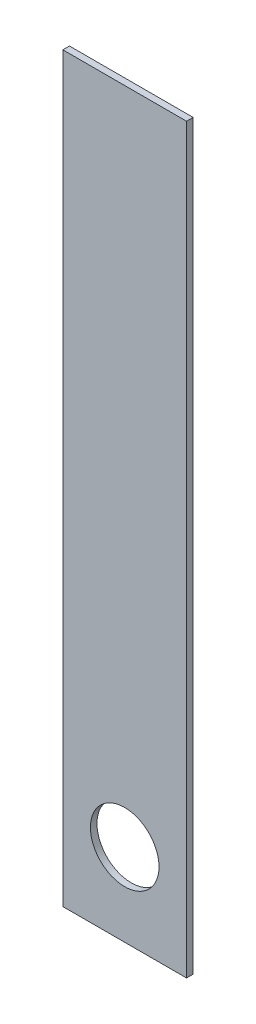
ISO-10303-21;
HEADER;
FILE_DESCRIPTION(('STEP AP214'),'2;1');
FILE_NAME('part.step','',(''),(''),'','','');
FILE_SCHEMA(('AUTOMOTIVE_DESIGN { 1 0 10303 214 1 1 1 1 }'));
ENDSEC;
DATA;
#1=APPLICATION_CONTEXT('core data for automotive mechanical design processes');
#2=APPLICATION_PROTOCOL_DEFINITION('international standard','automotive_design',2000,#1);
#3=PRODUCT_CONTEXT('',#1,'mechanical');
#4=PRODUCT('Part','Part','',(#3));
#5=PRODUCT_RELATED_PRODUCT_CATEGORY('part','',(#4));
#6=PRODUCT_DEFINITION_FORMATION('','',#4);
#7=PRODUCT_DEFINITION_CONTEXT('part definition',#1,'design');
#8=PRODUCT_DEFINITION('design','',#6,#7);
#9=PRODUCT_DEFINITION_SHAPE('','',#8);
#10=(LENGTH_UNIT() NAMED_UNIT(*) SI_UNIT(.MILLI.,.METRE.));
#11=(NAMED_UNIT(*) PLANE_ANGLE_UNIT() SI_UNIT($,.RADIAN.));
#12=(NAMED_UNIT(*) SI_UNIT($,.STERADIAN.) SOLID_ANGLE_UNIT());
#13=UNCERTAINTY_MEASURE_WITH_UNIT(LENGTH_MEASURE(1.E-05),#10,'distance_accuracy_value','');
#14=(GEOMETRIC_REPRESENTATION_CONTEXT(3) GLOBAL_UNCERTAINTY_ASSIGNED_CONTEXT((#13)) GLOBAL_UNIT_ASSIGNED_CONTEXT((#10,
#11,#12)) REPRESENTATION_CONTEXT('',''));
#15=CARTESIAN_POINT('',(0.,0.,0.));
#16=DIRECTION('',(0.,0.,1.));
#17=DIRECTION('',(1.,0.,0.));
#18=AXIS2_PLACEMENT_3D('',#15,#16,#17);
#19=CARTESIAN_POINT('',(-2.38125000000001,0.,0.254));
#20=DIRECTION('',(1.,0.,0.));
#21=DIRECTION('',(0.,0.,-1.));
#22=AXIS2_PLACEMENT_3D('',#19,#20,#21);
#23=PLANE('',#22);
#24=DIRECTION('',(0.,-1.,0.));
#25=VECTOR('',#24,1.);
#26=CARTESIAN_POINT('',(-2.38125000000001,0.,0.));
#27=LINE('',#26,#25);
#28=CARTESIAN_POINT('',(-2.38125000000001,28.575,0.));
#29=VERTEX_POINT('',#28);
#30=CARTESIAN_POINT('',(-2.38125000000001,0.,0.));
#31=VERTEX_POINT('',#30);
#32=EDGE_CURVE('E76',#29,#31,#27,.T.);
#33=ORIENTED_EDGE('',*,*,#32,.T.);
#34=DIRECTION('',(0.,0.,-1.));
#35=VECTOR('',#34,1.);
#36=CARTESIAN_POINT('',(-2.38125000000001,0.,0.254));
#37=LINE('',#36,#35);
#38=CARTESIAN_POINT('',(-2.38125000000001,0.,0.254));
#39=VERTEX_POINT('',#38);
#40=EDGE_CURVE('E11',#39,#31,#37,.T.);
#41=ORIENTED_EDGE('',*,*,#40,.F.);
#42=DIRECTION('',(0.,-1.,0.));
#43=VECTOR('',#42,1.);
#44=CARTESIAN_POINT('',(-2.38125000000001,0.,0.254));
#45=LINE('',#44,#43);
#46=CARTESIAN_POINT('',(-2.38125000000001,28.575,0.254));
#47=VERTEX_POINT('',#46);
#48=EDGE_CURVE('E99',#47,#39,#45,.T.);
#49=ORIENTED_EDGE('',*,*,#48,.F.);
#50=DIRECTION('',(0.,0.,-1.));
#51=VECTOR('',#50,1.);
#52=CARTESIAN_POINT('',(-2.38125000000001,28.575,0.254));
#53=LINE('',#52,#51);
#54=EDGE_CURVE('E88',#47,#29,#53,.T.);
#55=ORIENTED_EDGE('',*,*,#54,.T.);
#56=EDGE_LOOP('',(#33,#41,#49,#55));
#57=FACE_BOUND('',#56,.T.);
#58=ADVANCED_FACE('F32',(#57),#23,.F.);
#59=CARTESIAN_POINT('',(-2.38125000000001,0.,0.254));
#60=DIRECTION('',(0.,1.,0.));
#61=DIRECTION('',(-1.,0.,0.));
#62=AXIS2_PLACEMENT_3D('',#59,#60,#61);
#63=PLANE('',#62);
#64=DIRECTION('',(1.,0.,0.));
#65=VECTOR('',#64,1.);
#66=CARTESIAN_POINT('',(-2.38125000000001,0.,0.));
#67=LINE('',#66,#65);
#68=CARTESIAN_POINT('',(2.38125000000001,0.,0.));
#69=VERTEX_POINT('',#68);
#70=EDGE_CURVE('E72',#31,#69,#67,.T.);
#71=ORIENTED_EDGE('',*,*,#70,.T.);
#72=DIRECTION('',(0.,0.,-1.));
#73=VECTOR('',#72,1.);
#74=CARTESIAN_POINT('',(2.38125000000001,0.,0.254));
#75=LINE('',#74,#73);
#76=CARTESIAN_POINT('',(2.38125000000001,0.,0.254));
#77=VERTEX_POINT('',#76);
#78=EDGE_CURVE('E39',#77,#69,#75,.T.);
#79=ORIENTED_EDGE('',*,*,#78,.F.);
#80=DIRECTION('',(1.,0.,0.));
#81=VECTOR('',#80,1.);
#82=CARTESIAN_POINT('',(-2.38125000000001,0.,0.254));
#83=LINE('',#82,#81);
#84=EDGE_CURVE('E84',#39,#77,#83,.T.);
#85=ORIENTED_EDGE('',*,*,#84,.F.);
#86=ORIENTED_EDGE('',*,*,#40,.T.);
#87=EDGE_LOOP('',(#71,#79,#85,#86));
#88=FACE_BOUND('',#87,.T.);
#89=ADVANCED_FACE('F83',(#88),#63,.F.);
#90=CARTESIAN_POINT('',(2.38125000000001,0.,0.254));
#91=DIRECTION('',(-1.,0.,0.));
#92=DIRECTION('',(0.,-1.,0.));
#93=AXIS2_PLACEMENT_3D('',#90,#91,#92);
#94=PLANE('',#93);
#95=DIRECTION('',(0.,1.,0.));
#96=VECTOR('',#95,1.);
#97=CARTESIAN_POINT('',(2.38125000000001,0.,0.));
#98=LINE('',#97,#96);
#99=CARTESIAN_POINT('',(2.38124999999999,28.575,0.));
#100=VERTEX_POINT('',#99);
#101=EDGE_CURVE('E77',#69,#100,#98,.T.);
#102=ORIENTED_EDGE('',*,*,#101,.T.);
#103=DIRECTION('',(0.,0.,-1.));
#104=VECTOR('',#103,1.);
#105=CARTESIAN_POINT('',(2.38124999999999,28.575,0.254));
#106=LINE('',#105,#104);
#107=CARTESIAN_POINT('',(2.38124999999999,28.575,0.254));
#108=VERTEX_POINT('',#107);
#109=EDGE_CURVE('E105',#108,#100,#106,.T.);
#110=ORIENTED_EDGE('',*,*,#109,.F.);
#111=DIRECTION('',(0.,1.,0.));
#112=VECTOR('',#111,1.);
#113=CARTESIAN_POINT('',(2.38125000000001,0.,0.254));
#114=LINE('',#113,#112);
#115=EDGE_CURVE('E51',#77,#108,#114,.T.);
#116=ORIENTED_EDGE('',*,*,#115,.F.);
#117=ORIENTED_EDGE('',*,*,#78,.T.);
#118=EDGE_LOOP('',(#102,#110,#116,#117));
#119=FACE_BOUND('',#118,.T.);
#120=ADVANCED_FACE('F108',(#119),#94,.F.);
#121=CARTESIAN_POINT('',(-2.38125000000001,28.575,0.254));
#122=DIRECTION('',(0.,-1.,0.));
#123=DIRECTION('',(0.,0.,-1.));
#124=AXIS2_PLACEMENT_3D('',#121,#122,#123);
#125=PLANE('',#124);
#126=DIRECTION('',(-1.,0.,0.));
#127=VECTOR('',#126,1.);
#128=CARTESIAN_POINT('',(-2.38125000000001,28.575,0.));
#129=LINE('',#128,#127);
#130=EDGE_CURVE('E97',#100,#29,#129,.T.);
#131=ORIENTED_EDGE('',*,*,#130,.T.);
#132=ORIENTED_EDGE('',*,*,#54,.F.);
#133=DIRECTION('',(-1.,0.,0.));
#134=VECTOR('',#133,1.);
#135=CARTESIAN_POINT('',(-2.38125000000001,28.575,0.254));
#136=LINE('',#135,#134);
#137=EDGE_CURVE('E46',#108,#47,#136,.T.);
#138=ORIENTED_EDGE('',*,*,#137,.F.);
#139=ORIENTED_EDGE('',*,*,#109,.T.);
#140=EDGE_LOOP('',(#131,#132,#138,#139));
#141=FACE_BOUND('',#140,.T.);
#142=ADVANCED_FACE('F110',(#141),#125,.F.);
#143=CARTESIAN_POINT('',(-2.38125000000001,28.575,0.254));
#144=DIRECTION('',(0.,0.,-1.));
#145=DIRECTION('',(-1.,0.,0.));
#146=AXIS2_PLACEMENT_3D('',#143,#144,#145);
#147=PLANE('',#146);
#148=CARTESIAN_POINT('',(0.,3.175,0.254));
#149=DIRECTION('',(0.,0.,1.));
#150=DIRECTION('',(1.,0.,0.));
#151=AXIS2_PLACEMENT_3D('',#148,#149,#150);
#152=CIRCLE('',#151,1.3208);
#153=CARTESIAN_POINT('',(1.3208,3.175,0.254));
#154=VERTEX_POINT('',#153);
#155=EDGE_CURVE('E92',#154,#154,#152,.T.);
#156=ORIENTED_EDGE('',*,*,#155,.F.);
#157=EDGE_LOOP('',(#156));
#158=FACE_BOUND('',#157,.T.);
#159=ORIENTED_EDGE('',*,*,#48,.T.);
#160=ORIENTED_EDGE('',*,*,#84,.T.);
#161=ORIENTED_EDGE('',*,*,#115,.T.);
#162=ORIENTED_EDGE('',*,*,#137,.T.);
#163=EDGE_LOOP('',(#159,#160,#161,#162));
#164=FACE_BOUND('',#163,.T.);
#165=ADVANCED_FACE('F111',(#158,#164),#147,.F.);
#166=CARTESIAN_POINT('',(-2.38125000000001,28.575,0.));
#167=DIRECTION('',(0.,0.,-1.));
#168=DIRECTION('',(-1.,0.,0.));
#169=AXIS2_PLACEMENT_3D('',#166,#167,#168);
#170=PLANE('',#169);
#171=CARTESIAN_POINT('',(0.,3.175,0.));
#172=DIRECTION('',(0.,0.,-1.));
#173=DIRECTION('',(-1.,0.,0.));
#174=AXIS2_PLACEMENT_3D('',#171,#172,#173);
#175=CIRCLE('',#174,1.3208);
#176=CARTESIAN_POINT('',(-1.3208,3.175,0.));
#177=VERTEX_POINT('',#176);
#178=EDGE_CURVE('E89',#177,#177,#175,.T.);
#179=ORIENTED_EDGE('',*,*,#178,.F.);
#180=EDGE_LOOP('',(#179));
#181=FACE_BOUND('',#180,.T.);
#182=ORIENTED_EDGE('',*,*,#32,.F.);
#183=ORIENTED_EDGE('',*,*,#130,.F.);
#184=ORIENTED_EDGE('',*,*,#101,.F.);
#185=ORIENTED_EDGE('',*,*,#70,.F.);
#186=EDGE_LOOP('',(#182,#183,#184,#185));
#187=FACE_BOUND('',#186,.T.);
#188=ADVANCED_FACE('F73',(#181,#187),#170,.T.);
#189=CARTESIAN_POINT('',(0.,3.175,0.254));
#190=DIRECTION('',(0.,0.,1.));
#191=DIRECTION('',(1.,0.,0.));
#192=AXIS2_PLACEMENT_3D('',#189,#190,#191);
#193=CYLINDRICAL_SURFACE('',#192,1.3208);
#194=ORIENTED_EDGE('',*,*,#178,.T.);
#195=EDGE_LOOP('',(#194));
#196=FACE_BOUND('',#195,.T.);
#197=ORIENTED_EDGE('',*,*,#155,.T.);
#198=EDGE_LOOP('',(#197));
#199=FACE_BOUND('',#198,.T.);
#200=ADVANCED_FACE('F119',(#196,#199),#193,.F.);
#201=CLOSED_SHELL('',(#58,#89,#120,#142,#165,#188,#200));
#202=MANIFOLD_SOLID_BREP('B2',#201);
#203=ADVANCED_BREP_SHAPE_REPRESENTATION('',(#18,#202),#14);
#204=SHAPE_DEFINITION_REPRESENTATION(#9,#203);
ENDSEC;
END-ISO-10303-21;
